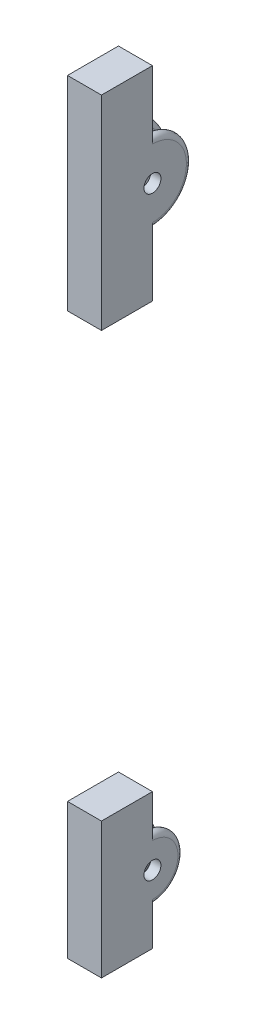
from build123d import *

# Parameters (mm, degrees)
SKETCH1_W               = 20
SKETCH1_H               = 120
BOSS_EXTRUDE1_DEPTH     = 30
SKETCH1_H_2             = 80
BOSS_EXTRUDE1_2_DEPTH   = 30
REVOLVE1_ANGLE          = 180
SKETCH3_R               = 5
CUT_EXTRUDE1_DEPTH      = 392.663120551
SKETCH4_W               = 8
SKETCH4_H               = 15
SKETCH6_W               = 8
SKETCH6_H               = 15
CUT_EXTRUDE2_DEPTH      = 392.402606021
CUT_EXTRUDE2_DEPTH_BACK = 392.402606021
SKETCH7_R               = 5


with BuildPart() as part:
    # Sketch1 → Boss-Extrude1 (new body)
    with BuildSketch(Plane.XY):
        Rectangle(SKETCH1_W, SKETCH1_H)
    extrude(amount=BOSS_EXTRUDE1_DEPTH)

    # Sketch2 → Revolve1 (revolve)
    with BuildSketch(Plane(origin=(0, 0, 0), x_dir=(-1, 0, 0), z_dir=(0, 0, -1))):
        with BuildLine():
            Line((-10, 0), (-4, 0))
            Line((-4, 0), (-4, 20))
            ThreePointArc((-4, 20), (-7, 23), (-10, 20))
            Line((-10, 20), (-10, 0))
        make_face()
        with BuildLine():
            Line((4, 0), (4, 20))
            ThreePointArc((4, 20), (7, 23), (10, 20))
            Line((10, 20), (10, 0))
            Line((10, 0), (4, 0))
        make_face()
    revolve(axis=Axis((10, 0, 0), (-1, 0, 0)), revolution_arc=REVOLVE1_ANGLE)

    # Sketch3 → Cut-Extrude1 (cut, through all)
    with BuildSketch(Plane(origin=(10, 0, 0), x_dir=(0, 0, -1), z_dir=(1, 0, 0))):
        Circle(SKETCH3_R)
    extrude(amount=-CUT_EXTRUDE1_DEPTH, mode=Mode.SUBTRACT)

    # Sketch4 → Cut-Revolve1 (revolve, cut)
    with BuildSketch(Plane(origin=(0, 0, 0), x_dir=(-1, 0, 0), z_dir=(0, 0, -1))):
        with Locations((0, 12.5)):
            Rectangle(SKETCH4_W, SKETCH4_H)
    revolve(axis=Axis((34.678911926, 0, 0), (-1, 0, 0)), mode=Mode.SUBTRACT)


with BuildPart() as body_2:
    # Sketch1 → Boss-Extrude1 2 (new body)
    with BuildSketch(Plane.XY):
        with Locations((0, -350)):
            Rectangle(SKETCH1_W, SKETCH1_H_2)
    extrude(amount=BOSS_EXTRUDE1_2_DEPTH)

    # Sketch5 → Revolve2 (revolve)
    with BuildSketch(Plane(origin=(0, 0, 0), x_dir=(-1, 0, 0), z_dir=(0, 0, -1))):
        with BuildLine():
            Line((-10, -350), (-4, -350))
            Line((-4, -350), (-4, -335))
            ThreePointArc((-4, -335), (-7, -332), (-10, -335))
            Line((-10, -335), (-10, -350))
        make_face()
        with BuildLine():
            Line((4, -350), (4, -335))
            ThreePointArc((4, -335), (7, -332), (10, -335))
            Line((10, -335), (10, -350))
            Line((10, -350), (4, -350))
        make_face()
    revolve(axis=Axis((10, -350, 0), (-1, 0, 0)))

    # Sketch6 → Cut-Revolve2 (revolve, cut)
    with BuildSketch(Plane(origin=(0, 0, 0), x_dir=(-1, 0, 0), z_dir=(0, 0, -1))):
        with Locations((0, -342.5)):
            Rectangle(SKETCH6_W, SKETCH6_H)
    revolve(axis=Axis((4, -350, 0), (-1, 0, 0)), mode=Mode.SUBTRACT)

    # Sketch7 → Cut-Extrude2 (cut, two sides: drawn at the far end of the back side and taken through both)
    with BuildSketch(Plane(origin=(-4, 0, 0), x_dir=(0, 0, -1), z_dir=(1, 0, 0)).offset(-CUT_EXTRUDE2_DEPTH_BACK)):
        with Locations((0, -350)):
            Circle(SKETCH7_R)
    extrude(amount=CUT_EXTRUDE2_DEPTH + CUT_EXTRUDE2_DEPTH_BACK, mode=Mode.SUBTRACT)


solid = Compound([part.part, body_2.part])
